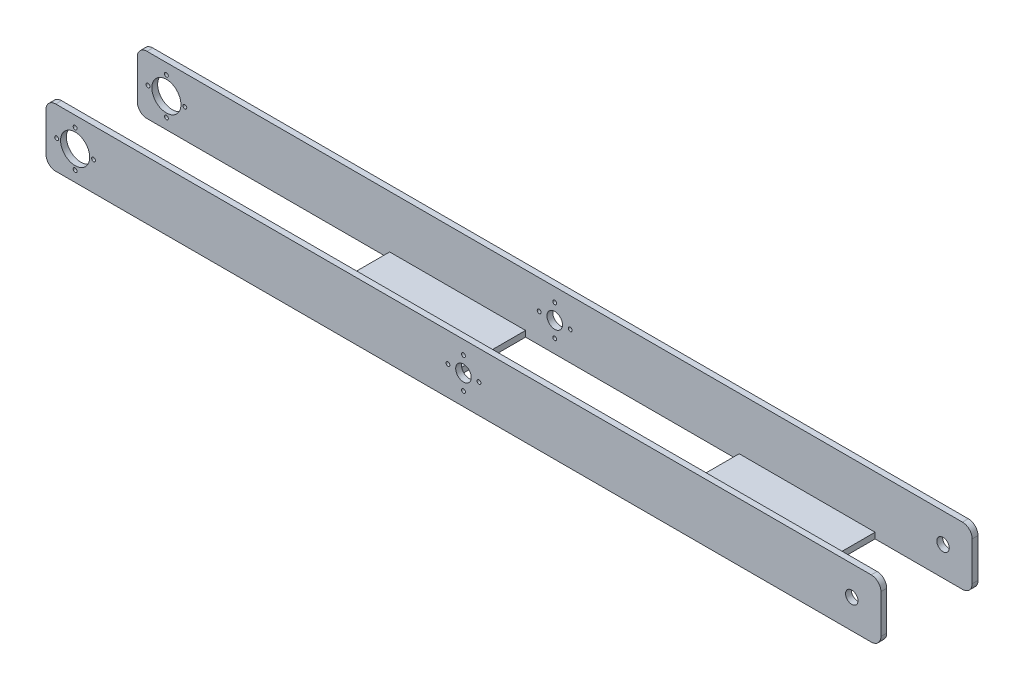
ISO-10303-21;
HEADER;
FILE_DESCRIPTION(('STEP AP214'),'2;1');
FILE_NAME('part.step','',(''),(''),'','','');
FILE_SCHEMA(('AUTOMOTIVE_DESIGN { 1 0 10303 214 1 1 1 1 }'));
ENDSEC;
DATA;
#1=APPLICATION_CONTEXT('core data for automotive mechanical design processes');
#2=APPLICATION_PROTOCOL_DEFINITION('international standard','automotive_design',2000,#1);
#3=PRODUCT_CONTEXT('',#1,'mechanical');
#4=PRODUCT('Part','Part','',(#3));
#5=PRODUCT_RELATED_PRODUCT_CATEGORY('part','',(#4));
#6=PRODUCT_DEFINITION_FORMATION('','',#4);
#7=PRODUCT_DEFINITION_CONTEXT('part definition',#1,'design');
#8=PRODUCT_DEFINITION('design','',#6,#7);
#9=PRODUCT_DEFINITION_SHAPE('','',#8);
#10=(LENGTH_UNIT() NAMED_UNIT(*) SI_UNIT(.MILLI.,.METRE.));
#11=(NAMED_UNIT(*) PLANE_ANGLE_UNIT() SI_UNIT($,.RADIAN.));
#12=(NAMED_UNIT(*) SI_UNIT($,.STERADIAN.) SOLID_ANGLE_UNIT());
#13=UNCERTAINTY_MEASURE_WITH_UNIT(LENGTH_MEASURE(1.E-05),#10,'distance_accuracy_value','');
#14=(GEOMETRIC_REPRESENTATION_CONTEXT(3) GLOBAL_UNCERTAINTY_ASSIGNED_CONTEXT((#13)) GLOBAL_UNIT_ASSIGNED_CONTEXT((#10,
#11,#12)) REPRESENTATION_CONTEXT('',''));
#15=CARTESIAN_POINT('',(0.,0.,0.));
#16=DIRECTION('',(0.,0.,1.));
#17=DIRECTION('',(1.,0.,0.));
#18=AXIS2_PLACEMENT_3D('',#15,#16,#17);
#19=CARTESIAN_POINT('',(215.,-15.,50.));
#20=DIRECTION('',(-1.,0.,0.));
#21=DIRECTION('',(0.,0.,1.));
#22=AXIS2_PLACEMENT_3D('',#19,#20,#21);
#23=PLANE('',#22);
#24=DIRECTION('',(0.,1.,0.));
#25=VECTOR('',#24,1.);
#26=CARTESIAN_POINT('',(215.,-15.,50.));
#27=LINE('',#26,#25);
#28=CARTESIAN_POINT('',(215.,-10.,50.));
#29=VERTEX_POINT('',#28);
#30=CARTESIAN_POINT('',(215.,10.,50.));
#31=VERTEX_POINT('',#30);
#32=EDGE_CURVE('E262',#29,#31,#27,.T.);
#33=ORIENTED_EDGE('',*,*,#32,.F.);
#34=DIRECTION('',(0.,0.,-1.));
#35=VECTOR('',#34,1.);
#36=CARTESIAN_POINT('',(215.,-10.,50.));
#37=LINE('',#36,#35);
#38=CARTESIAN_POINT('',(215.,-10.,47.));
#39=VERTEX_POINT('',#38);
#40=EDGE_CURVE('E387',#29,#39,#37,.T.);
#41=ORIENTED_EDGE('',*,*,#40,.T.);
#42=DIRECTION('',(0.,1.,0.));
#43=VECTOR('',#42,1.);
#44=CARTESIAN_POINT('',(215.,0.,47.));
#45=LINE('',#44,#43);
#46=CARTESIAN_POINT('',(215.,10.,47.));
#47=VERTEX_POINT('',#46);
#48=EDGE_CURVE('E259',#39,#47,#45,.T.);
#49=ORIENTED_EDGE('',*,*,#48,.T.);
#50=DIRECTION('',(0.,0.,-1.));
#51=VECTOR('',#50,1.);
#52=CARTESIAN_POINT('',(215.,10.,50.));
#53=LINE('',#52,#51);
#54=EDGE_CURVE('E385',#47,#31,#53,.F.);
#55=ORIENTED_EDGE('',*,*,#54,.T.);
#56=EDGE_LOOP('',(#33,#41,#49,#55));
#57=FACE_BOUND('',#56,.T.);
#58=ADVANCED_FACE('F43',(#57),#23,.F.);
#59=CARTESIAN_POINT('',(-215.,-15.,50.));
#60=DIRECTION('',(1.,0.,0.));
#61=DIRECTION('',(0.,0.,-1.));
#62=AXIS2_PLACEMENT_3D('',#59,#60,#61);
#63=PLANE('',#62);
#64=DIRECTION('',(0.,-1.,0.));
#65=VECTOR('',#64,1.);
#66=CARTESIAN_POINT('',(-215.,-15.,0.));
#67=LINE('',#66,#65);
#68=CARTESIAN_POINT('',(-215.,10.,0.));
#69=VERTEX_POINT('',#68);
#70=CARTESIAN_POINT('',(-215.,-10.,0.));
#71=VERTEX_POINT('',#70);
#72=EDGE_CURVE('E276',#69,#71,#67,.T.);
#73=ORIENTED_EDGE('',*,*,#72,.T.);
#74=DIRECTION('',(0.,0.,-1.));
#75=VECTOR('',#74,1.);
#76=CARTESIAN_POINT('',(-215.,-10.,50.));
#77=LINE('',#76,#75);
#78=CARTESIAN_POINT('',(-215.,-10.,3.));
#79=VERTEX_POINT('',#78);
#80=EDGE_CURVE('E346',#71,#79,#77,.F.);
#81=ORIENTED_EDGE('',*,*,#80,.T.);
#82=DIRECTION('',(0.,-1.,0.));
#83=VECTOR('',#82,1.);
#84=CARTESIAN_POINT('',(-215.,0.,3.));
#85=LINE('',#84,#83);
#86=CARTESIAN_POINT('',(-215.,10.,3.));
#87=VERTEX_POINT('',#86);
#88=EDGE_CURVE('E252',#87,#79,#85,.T.);
#89=ORIENTED_EDGE('',*,*,#88,.F.);
#90=DIRECTION('',(0.,0.,-1.));
#91=VECTOR('',#90,1.);
#92=CARTESIAN_POINT('',(-215.,10.,50.));
#93=LINE('',#92,#91);
#94=EDGE_CURVE('E343',#87,#69,#93,.T.);
#95=ORIENTED_EDGE('',*,*,#94,.T.);
#96=EDGE_LOOP('',(#73,#81,#89,#95));
#97=FACE_BOUND('',#96,.T.);
#98=ADVANCED_FACE('F418',(#97),#63,.F.);
#99=CARTESIAN_POINT('',(-215.,-12.,50.));
#100=DIRECTION('',(0.,1.,0.));
#101=DIRECTION('',(0.,0.,1.));
#102=AXIS2_PLACEMENT_3D('',#99,#100,#101);
#103=PLANE('',#102);
#104=DIRECTION('',(0.,0.,-1.));
#105=VECTOR('',#104,1.);
#106=CARTESIAN_POINT('',(-84.9999999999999,-12.,3.));
#107=LINE('',#106,#105);
#108=CARTESIAN_POINT('',(-84.9999999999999,-12.,47.));
#109=VERTEX_POINT('',#108);
#110=CARTESIAN_POINT('',(-84.9999999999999,-12.,3.));
#111=VERTEX_POINT('',#110);
#112=EDGE_CURVE('E209',#109,#111,#107,.T.);
#113=ORIENTED_EDGE('',*,*,#112,.F.);
#114=DIRECTION('',(1.,0.,0.));
#115=VECTOR('',#114,1.);
#116=CARTESIAN_POINT('',(0.,-12.,47.));
#117=LINE('',#116,#115);
#118=CARTESIAN_POINT('',(-14.9999999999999,-12.,47.));
#119=VERTEX_POINT('',#118);
#120=EDGE_CURVE('E224',#109,#119,#117,.T.);
#121=ORIENTED_EDGE('',*,*,#120,.T.);
#122=DIRECTION('',(0.,0.,1.));
#123=VECTOR('',#122,1.);
#124=CARTESIAN_POINT('',(-14.9999999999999,-12.,3.00000000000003));
#125=LINE('',#124,#123);
#126=CARTESIAN_POINT('',(-14.9999999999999,-12.,3.00000000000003));
#127=VERTEX_POINT('',#126);
#128=EDGE_CURVE('E462',#127,#119,#125,.T.);
#129=ORIENTED_EDGE('',*,*,#128,.F.);
#130=DIRECTION('',(1.,0.,0.));
#131=VECTOR('',#130,1.);
#132=CARTESIAN_POINT('',(0.,-12.,3.));
#133=LINE('',#132,#131);
#134=EDGE_CURVE('E226',#111,#127,#133,.T.);
#135=ORIENTED_EDGE('',*,*,#134,.F.);
#136=EDGE_LOOP('',(#113,#121,#129,#135));
#137=FACE_BOUND('',#136,.T.);
#138=ADVANCED_FACE('F222',(#137),#103,.T.);
#139=DIRECTION('',(0.,1.,0.));
#140=VECTOR('',#139,1.);
#141=CARTESIAN_POINT('',(215.,0.,3.));
#142=LINE('',#141,#140);
#143=CARTESIAN_POINT('',(215.,-10.,3.));
#144=VERTEX_POINT('',#143);
#145=CARTESIAN_POINT('',(215.,10.,3.));
#146=VERTEX_POINT('',#145);
#147=EDGE_CURVE('E245',#144,#146,#142,.T.);
#148=ORIENTED_EDGE('',*,*,#147,.F.);
#149=DIRECTION('',(0.,0.,-1.));
#150=VECTOR('',#149,1.);
#151=CARTESIAN_POINT('',(215.,-10.,50.));
#152=LINE('',#151,#150);
#153=CARTESIAN_POINT('',(215.,-10.,0.));
#154=VERTEX_POINT('',#153);
#155=EDGE_CURVE('E11',#144,#154,#152,.T.);
#156=ORIENTED_EDGE('',*,*,#155,.T.);
#157=DIRECTION('',(0.,1.,0.));
#158=VECTOR('',#157,1.);
#159=CARTESIAN_POINT('',(215.,-15.,0.));
#160=LINE('',#159,#158);
#161=CARTESIAN_POINT('',(215.,10.,0.));
#162=VERTEX_POINT('',#161);
#163=EDGE_CURVE('E233',#154,#162,#160,.T.);
#164=ORIENTED_EDGE('',*,*,#163,.T.);
#165=DIRECTION('',(0.,0.,-1.));
#166=VECTOR('',#165,1.);
#167=CARTESIAN_POINT('',(215.,10.,50.));
#168=LINE('',#167,#166);
#169=EDGE_CURVE('E51',#162,#146,#168,.F.);
#170=ORIENTED_EDGE('',*,*,#169,.T.);
#171=EDGE_LOOP('',(#148,#156,#164,#170));
#172=FACE_BOUND('',#171,.T.);
#173=ADVANCED_FACE('F392',(#172),#23,.F.);
#174=CARTESIAN_POINT('',(-215.,15.,50.));
#175=DIRECTION('',(0.,-1.,0.));
#176=DIRECTION('',(0.,0.,-1.));
#177=AXIS2_PLACEMENT_3D('',#174,#175,#176);
#178=PLANE('',#177);
#179=DIRECTION('',(-1.,0.,0.));
#180=VECTOR('',#179,1.);
#181=CARTESIAN_POINT('',(-215.,15.,0.));
#182=LINE('',#181,#180);
#183=CARTESIAN_POINT('',(210.,15.,0.));
#184=VERTEX_POINT('',#183);
#185=CARTESIAN_POINT('',(-210.,15.,0.));
#186=VERTEX_POINT('',#185);
#187=EDGE_CURVE('E237',#184,#186,#182,.T.);
#188=ORIENTED_EDGE('',*,*,#187,.T.);
#189=DIRECTION('',(0.,0.,-1.));
#190=VECTOR('',#189,1.);
#191=CARTESIAN_POINT('',(-210.,15.,50.));
#192=LINE('',#191,#190);
#193=CARTESIAN_POINT('',(-210.,15.,3.));
#194=VERTEX_POINT('',#193);
#195=EDGE_CURVE('E359',#186,#194,#192,.F.);
#196=ORIENTED_EDGE('',*,*,#195,.T.);
#197=DIRECTION('',(-1.,0.,0.));
#198=VECTOR('',#197,1.);
#199=CARTESIAN_POINT('',(0.,15.,3.));
#200=LINE('',#199,#198);
#201=CARTESIAN_POINT('',(210.,15.,3.));
#202=VERTEX_POINT('',#201);
#203=EDGE_CURVE('E248',#202,#194,#200,.T.);
#204=ORIENTED_EDGE('',*,*,#203,.F.);
#205=DIRECTION('',(0.,0.,-1.));
#206=VECTOR('',#205,1.);
#207=CARTESIAN_POINT('',(210.,15.,50.));
#208=LINE('',#207,#206);
#209=EDGE_CURVE('E356',#202,#184,#208,.T.);
#210=ORIENTED_EDGE('',*,*,#209,.T.);
#211=EDGE_LOOP('',(#188,#196,#204,#210));
#212=FACE_BOUND('',#211,.T.);
#213=ADVANCED_FACE('F406',(#212),#178,.F.);
#214=DIRECTION('',(0.,-1.,0.));
#215=VECTOR('',#214,1.);
#216=CARTESIAN_POINT('',(-215.,0.,47.));
#217=LINE('',#216,#215);
#218=CARTESIAN_POINT('',(-215.,10.,47.));
#219=VERTEX_POINT('',#218);
#220=CARTESIAN_POINT('',(-215.,-10.,47.));
#221=VERTEX_POINT('',#220);
#222=EDGE_CURVE('E240',#219,#221,#217,.T.);
#223=ORIENTED_EDGE('',*,*,#222,.T.);
#224=DIRECTION('',(0.,0.,-1.));
#225=VECTOR('',#224,1.);
#226=CARTESIAN_POINT('',(-215.,-10.,50.));
#227=LINE('',#226,#225);
#228=CARTESIAN_POINT('',(-215.,-10.,50.));
#229=VERTEX_POINT('',#228);
#230=EDGE_CURVE('E372',#221,#229,#227,.F.);
#231=ORIENTED_EDGE('',*,*,#230,.T.);
#232=DIRECTION('',(0.,-1.,0.));
#233=VECTOR('',#232,1.);
#234=CARTESIAN_POINT('',(-215.,-15.,50.));
#235=LINE('',#234,#233);
#236=CARTESIAN_POINT('',(-215.,10.,50.));
#237=VERTEX_POINT('',#236);
#238=EDGE_CURVE('E267',#237,#229,#235,.T.);
#239=ORIENTED_EDGE('',*,*,#238,.F.);
#240=DIRECTION('',(0.,0.,-1.));
#241=VECTOR('',#240,1.);
#242=CARTESIAN_POINT('',(-215.,10.,50.));
#243=LINE('',#242,#241);
#244=EDGE_CURVE('E369',#237,#219,#243,.T.);
#245=ORIENTED_EDGE('',*,*,#244,.T.);
#246=EDGE_LOOP('',(#223,#231,#239,#245));
#247=FACE_BOUND('',#246,.T.);
#248=ADVANCED_FACE('F592',(#247),#63,.F.);
#249=DIRECTION('',(-1.,0.,0.));
#250=VECTOR('',#249,1.);
#251=CARTESIAN_POINT('',(0.,15.,47.));
#252=LINE('',#251,#250);
#253=CARTESIAN_POINT('',(210.,15.,47.));
#254=VERTEX_POINT('',#253);
#255=CARTESIAN_POINT('',(-210.,15.,47.));
#256=VERTEX_POINT('',#255);
#257=EDGE_CURVE('E257',#254,#256,#252,.T.);
#258=ORIENTED_EDGE('',*,*,#257,.T.);
#259=DIRECTION('',(0.,0.,-1.));
#260=VECTOR('',#259,1.);
#261=CARTESIAN_POINT('',(-210.,15.,50.));
#262=LINE('',#261,#260);
#263=CARTESIAN_POINT('',(-210.,15.,50.));
#264=VERTEX_POINT('',#263);
#265=EDGE_CURVE('E58',#256,#264,#262,.F.);
#266=ORIENTED_EDGE('',*,*,#265,.T.);
#267=DIRECTION('',(-1.,0.,0.));
#268=VECTOR('',#267,1.);
#269=CARTESIAN_POINT('',(-215.,15.,50.));
#270=LINE('',#269,#268);
#271=CARTESIAN_POINT('',(210.,15.,50.));
#272=VERTEX_POINT('',#271);
#273=EDGE_CURVE('E264',#272,#264,#270,.T.);
#274=ORIENTED_EDGE('',*,*,#273,.F.);
#275=DIRECTION('',(0.,0.,-1.));
#276=VECTOR('',#275,1.);
#277=CARTESIAN_POINT('',(210.,15.,50.));
#278=LINE('',#277,#276);
#279=EDGE_CURVE('E381',#272,#254,#278,.T.);
#280=ORIENTED_EDGE('',*,*,#279,.T.);
#281=EDGE_LOOP('',(#258,#266,#274,#280));
#282=FACE_BOUND('',#281,.T.);
#283=ADVANCED_FACE('F601',(#282),#178,.F.);
#284=CARTESIAN_POINT('',(-215.,-15.,50.));
#285=DIRECTION('',(0.,1.,0.));
#286=DIRECTION('',(0.,0.,1.));
#287=AXIS2_PLACEMENT_3D('',#284,#285,#286);
#288=PLANE('',#287);
#289=DIRECTION('',(1.,0.,0.));
#290=VECTOR('',#289,1.);
#291=CARTESIAN_POINT('',(-14.9999999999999,-15.,3.00000000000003));
#292=LINE('',#291,#290);
#293=CARTESIAN_POINT('',(-14.9999999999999,-15.,3.00000000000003));
#294=VERTEX_POINT('',#293);
#295=CARTESIAN_POINT('',(95.0000000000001,-15.,3.00000000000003));
#296=VERTEX_POINT('',#295);
#297=EDGE_CURVE('E438',#294,#296,#292,.T.);
#298=ORIENTED_EDGE('',*,*,#297,.F.);
#299=DIRECTION('',(0.,0.,-1.));
#300=VECTOR('',#299,1.);
#301=CARTESIAN_POINT('',(-14.9999999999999,-15.,3.00000000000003));
#302=LINE('',#301,#300);
#303=CARTESIAN_POINT('',(-14.9999999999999,-15.,47.));
#304=VERTEX_POINT('',#303);
#305=EDGE_CURVE('E464',#304,#294,#302,.T.);
#306=ORIENTED_EDGE('',*,*,#305,.F.);
#307=DIRECTION('',(-1.,0.,0.));
#308=VECTOR('',#307,1.);
#309=CARTESIAN_POINT('',(-14.9999999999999,-15.,47.));
#310=LINE('',#309,#308);
#311=CARTESIAN_POINT('',(95.0000000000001,-15.,47.));
#312=VERTEX_POINT('',#311);
#313=EDGE_CURVE('E450',#312,#304,#310,.T.);
#314=ORIENTED_EDGE('',*,*,#313,.F.);
#315=DIRECTION('',(0.,0.,1.));
#316=VECTOR('',#315,1.);
#317=CARTESIAN_POINT('',(95.0000000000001,-15.,3.00000000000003));
#318=LINE('',#317,#316);
#319=EDGE_CURVE('E436',#296,#312,#318,.T.);
#320=ORIENTED_EDGE('',*,*,#319,.F.);
#321=EDGE_LOOP('',(#298,#306,#314,#320));
#322=FACE_BOUND('',#321,.T.);
#323=DIRECTION('',(1.,0.,0.));
#324=VECTOR('',#323,1.);
#325=CARTESIAN_POINT('',(-215.,-15.,3.));
#326=LINE('',#325,#324);
#327=CARTESIAN_POINT('',(-210.,-15.,3.));
#328=VERTEX_POINT('',#327);
#329=CARTESIAN_POINT('',(-84.9999999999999,-15.,3.));
#330=VERTEX_POINT('',#329);
#331=EDGE_CURVE('E227',#328,#330,#326,.T.);
#332=ORIENTED_EDGE('',*,*,#331,.F.);
#333=DIRECTION('',(0.,0.,-1.));
#334=VECTOR('',#333,1.);
#335=CARTESIAN_POINT('',(-210.,-15.,50.));
#336=LINE('',#335,#334);
#337=CARTESIAN_POINT('',(-210.,-15.,0.));
#338=VERTEX_POINT('',#337);
#339=EDGE_CURVE('E332',#328,#338,#336,.T.);
#340=ORIENTED_EDGE('',*,*,#339,.T.);
#341=DIRECTION('',(1.,0.,0.));
#342=VECTOR('',#341,1.);
#343=CARTESIAN_POINT('',(-215.,-15.,0.));
#344=LINE('',#343,#342);
#345=CARTESIAN_POINT('',(210.,-15.,0.));
#346=VERTEX_POINT('',#345);
#347=EDGE_CURVE('E265',#338,#346,#344,.T.);
#348=ORIENTED_EDGE('',*,*,#347,.T.);
#349=DIRECTION('',(0.,0.,-1.));
#350=VECTOR('',#349,1.);
#351=CARTESIAN_POINT('',(210.,-15.,50.));
#352=LINE('',#351,#350);
#353=CARTESIAN_POINT('',(210.,-15.,3.));
#354=VERTEX_POINT('',#353);
#355=EDGE_CURVE('E272',#346,#354,#352,.F.);
#356=ORIENTED_EDGE('',*,*,#355,.T.);
#357=DIRECTION('',(1.,0.,0.));
#358=VECTOR('',#357,1.);
#359=CARTESIAN_POINT('',(215.,-15.,3.));
#360=LINE('',#359,#358);
#361=CARTESIAN_POINT('',(165.,-15.,3.00000000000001));
#362=VERTEX_POINT('',#361);
#363=EDGE_CURVE('E432',#362,#354,#360,.T.);
#364=ORIENTED_EDGE('',*,*,#363,.F.);
#365=DIRECTION('',(0.,0.,-1.));
#366=VECTOR('',#365,1.);
#367=CARTESIAN_POINT('',(165.,-15.,3.00000000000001));
#368=LINE('',#367,#366);
#369=CARTESIAN_POINT('',(165.,-15.,47.));
#370=VERTEX_POINT('',#369);
#371=EDGE_CURVE('E448',#370,#362,#368,.T.);
#372=ORIENTED_EDGE('',*,*,#371,.F.);
#373=DIRECTION('',(-1.,0.,0.));
#374=VECTOR('',#373,1.);
#375=CARTESIAN_POINT('',(215.,-15.,47.));
#376=LINE('',#375,#374);
#377=CARTESIAN_POINT('',(210.,-15.,47.));
#378=VERTEX_POINT('',#377);
#379=EDGE_CURVE('E446',#378,#370,#376,.T.);
#380=ORIENTED_EDGE('',*,*,#379,.F.);
#381=DIRECTION('',(0.,0.,-1.));
#382=VECTOR('',#381,1.);
#383=CARTESIAN_POINT('',(210.,-15.,50.));
#384=LINE('',#383,#382);
#385=CARTESIAN_POINT('',(210.,-15.,50.));
#386=VERTEX_POINT('',#385);
#387=EDGE_CURVE('E327',#378,#386,#384,.F.);
#388=ORIENTED_EDGE('',*,*,#387,.T.);
#389=DIRECTION('',(1.,0.,0.));
#390=VECTOR('',#389,1.);
#391=CARTESIAN_POINT('',(-215.,-15.,50.));
#392=LINE('',#391,#390);
#393=CARTESIAN_POINT('',(-210.,-15.,50.));
#394=VERTEX_POINT('',#393);
#395=EDGE_CURVE('E270',#394,#386,#392,.T.);
#396=ORIENTED_EDGE('',*,*,#395,.F.);
#397=DIRECTION('',(0.,0.,-1.));
#398=VECTOR('',#397,1.);
#399=CARTESIAN_POINT('',(-210.,-15.,50.));
#400=LINE('',#399,#398);
#401=CARTESIAN_POINT('',(-210.,-15.,47.));
#402=VERTEX_POINT('',#401);
#403=EDGE_CURVE('E329',#394,#402,#400,.T.);
#404=ORIENTED_EDGE('',*,*,#403,.T.);
#405=DIRECTION('',(-1.,0.,0.));
#406=VECTOR('',#405,1.);
#407=CARTESIAN_POINT('',(-215.,-15.,47.));
#408=LINE('',#407,#406);
#409=CARTESIAN_POINT('',(-84.9999999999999,-15.,47.));
#410=VERTEX_POINT('',#409);
#411=EDGE_CURVE('E249',#410,#402,#408,.T.);
#412=ORIENTED_EDGE('',*,*,#411,.F.);
#413=DIRECTION('',(0.,0.,1.));
#414=VECTOR('',#413,1.);
#415=CARTESIAN_POINT('',(-84.9999999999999,-15.,3.));
#416=LINE('',#415,#414);
#417=EDGE_CURVE('E212',#330,#410,#416,.T.);
#418=ORIENTED_EDGE('',*,*,#417,.F.);
#419=EDGE_LOOP('',(#332,#340,#348,#356,#364,#372,#380,#388,#396,#404,#412,#418));
#420=FACE_BOUND('',#419,.T.);
#421=ADVANCED_FACE('F426',(#322,#420),#288,.F.);
#422=CARTESIAN_POINT('',(0.,0.,50.));
#423=DIRECTION('',(0.,0.,-1.));
#424=DIRECTION('',(-1.,0.,0.));
#425=AXIS2_PLACEMENT_3D('',#422,#423,#424);
#426=PLANE('',#425);
#427=CARTESIAN_POINT('',(8.,0.,50.));
#428=DIRECTION('',(0.,0.,-1.));
#429=DIRECTION('',(-1.,0.,0.));
#430=AXIS2_PLACEMENT_3D('',#427,#428,#429);
#431=CIRCLE('',#430,1.);
#432=CARTESIAN_POINT('',(7.,0.,50.));
#433=VERTEX_POINT('',#432);
#434=EDGE_CURVE('E541',#433,#433,#431,.T.);
#435=ORIENTED_EDGE('',*,*,#434,.T.);
#436=EDGE_LOOP('',(#435));
#437=FACE_BOUND('',#436,.T.);
#438=CARTESIAN_POINT('',(-8.,0.,50.));
#439=DIRECTION('',(0.,0.,-1.));
#440=DIRECTION('',(-1.,0.,0.));
#441=AXIS2_PLACEMENT_3D('',#438,#439,#440);
#442=CIRCLE('',#441,1.);
#443=CARTESIAN_POINT('',(-9.,0.,50.));
#444=VERTEX_POINT('',#443);
#445=EDGE_CURVE('E531',#444,#444,#442,.T.);
#446=ORIENTED_EDGE('',*,*,#445,.T.);
#447=EDGE_LOOP('',(#446));
#448=FACE_BOUND('',#447,.T.);
#449=CARTESIAN_POINT('',(0.,-8.,50.));
#450=DIRECTION('',(0.,0.,-1.));
#451=DIRECTION('',(-1.,0.,0.));
#452=AXIS2_PLACEMENT_3D('',#449,#450,#451);
#453=CIRCLE('',#452,1.);
#454=CARTESIAN_POINT('',(-1.,-8.,50.));
#455=VERTEX_POINT('',#454);
#456=EDGE_CURVE('E530',#455,#455,#453,.T.);
#457=ORIENTED_EDGE('',*,*,#456,.T.);
#458=EDGE_LOOP('',(#457));
#459=FACE_BOUND('',#458,.T.);
#460=CARTESIAN_POINT('',(0.,8.,50.));
#461=DIRECTION('',(0.,0.,-1.));
#462=DIRECTION('',(-1.,0.,0.));
#463=AXIS2_PLACEMENT_3D('',#460,#461,#462);
#464=CIRCLE('',#463,1.);
#465=CARTESIAN_POINT('',(-1.,8.,50.));
#466=VERTEX_POINT('',#465);
#467=EDGE_CURVE('E498',#466,#466,#464,.T.);
#468=ORIENTED_EDGE('',*,*,#467,.T.);
#469=EDGE_LOOP('',(#468));
#470=FACE_BOUND('',#469,.T.);
#471=CARTESIAN_POINT('',(-200.,-9.5,50.));
#472=DIRECTION('',(0.,0.,-1.));
#473=DIRECTION('',(-1.,0.,0.));
#474=AXIS2_PLACEMENT_3D('',#471,#472,#473);
#475=CIRCLE('',#474,0.999999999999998);
#476=CARTESIAN_POINT('',(-201.,-9.5,50.));
#477=VERTEX_POINT('',#476);
#478=EDGE_CURVE('E518',#477,#477,#475,.T.);
#479=ORIENTED_EDGE('',*,*,#478,.T.);
#480=EDGE_LOOP('',(#479));
#481=FACE_BOUND('',#480,.T.);
#482=CARTESIAN_POINT('',(-190.5,0.,50.));
#483=DIRECTION('',(0.,0.,-1.));
#484=DIRECTION('',(-1.,0.,0.));
#485=AXIS2_PLACEMENT_3D('',#482,#483,#484);
#486=CIRCLE('',#485,0.999999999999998);
#487=CARTESIAN_POINT('',(-191.5,0.,50.));
#488=VERTEX_POINT('',#487);
#489=EDGE_CURVE('E505',#488,#488,#486,.T.);
#490=ORIENTED_EDGE('',*,*,#489,.T.);
#491=EDGE_LOOP('',(#490));
#492=FACE_BOUND('',#491,.T.);
#493=CARTESIAN_POINT('',(-209.5,0.,50.));
#494=DIRECTION('',(0.,0.,-1.));
#495=DIRECTION('',(-1.,0.,0.));
#496=AXIS2_PLACEMENT_3D('',#493,#494,#495);
#497=CIRCLE('',#496,0.999999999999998);
#498=CARTESIAN_POINT('',(-210.5,0.,50.));
#499=VERTEX_POINT('',#498);
#500=EDGE_CURVE('E504',#499,#499,#497,.T.);
#501=ORIENTED_EDGE('',*,*,#500,.T.);
#502=EDGE_LOOP('',(#501));
#503=FACE_BOUND('',#502,.T.);
#504=CARTESIAN_POINT('',(-200.,9.5,50.));
#505=DIRECTION('',(0.,0.,-1.));
#506=DIRECTION('',(-1.,0.,0.));
#507=AXIS2_PLACEMENT_3D('',#504,#505,#506);
#508=CIRCLE('',#507,0.999999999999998);
#509=CARTESIAN_POINT('',(-201.,9.5,50.));
#510=VERTEX_POINT('',#509);
#511=EDGE_CURVE('E511',#510,#510,#508,.T.);
#512=ORIENTED_EDGE('',*,*,#511,.T.);
#513=EDGE_LOOP('',(#512));
#514=FACE_BOUND('',#513,.T.);
#515=CARTESIAN_POINT('',(-200.,0.,50.));
#516=DIRECTION('',(0.,0.,-1.));
#517=DIRECTION('',(-1.,0.,0.));
#518=AXIS2_PLACEMENT_3D('',#515,#516,#517);
#519=CIRCLE('',#518,7.50000000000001);
#520=CARTESIAN_POINT('',(-207.5,0.,50.));
#521=VERTEX_POINT('',#520);
#522=EDGE_CURVE('E519',#521,#521,#519,.T.);
#523=ORIENTED_EDGE('',*,*,#522,.T.);
#524=EDGE_LOOP('',(#523));
#525=FACE_BOUND('',#524,.T.);
#526=CARTESIAN_POINT('',(200.,0.,50.));
#527=DIRECTION('',(0.,0.,-1.));
#528=DIRECTION('',(-1.,0.,0.));
#529=AXIS2_PLACEMENT_3D('',#526,#527,#528);
#530=CIRCLE('',#529,3.20000000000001);
#531=CARTESIAN_POINT('',(196.8,0.,50.));
#532=VERTEX_POINT('',#531);
#533=EDGE_CURVE('E552',#532,#532,#530,.T.);
#534=ORIENTED_EDGE('',*,*,#533,.T.);
#535=EDGE_LOOP('',(#534));
#536=FACE_BOUND('',#535,.T.);
#537=CARTESIAN_POINT('',(0.,0.,50.));
#538=DIRECTION('',(0.,0.,-1.));
#539=DIRECTION('',(-1.,0.,0.));
#540=AXIS2_PLACEMENT_3D('',#537,#538,#539);
#541=CIRCLE('',#540,4.);
#542=CARTESIAN_POINT('',(-4.,0.,50.));
#543=VERTEX_POINT('',#542);
#544=EDGE_CURVE('E285',#543,#543,#541,.T.);
#545=ORIENTED_EDGE('',*,*,#544,.T.);
#546=EDGE_LOOP('',(#545));
#547=FACE_BOUND('',#546,.T.);
#548=ORIENTED_EDGE('',*,*,#238,.T.);
#549=CARTESIAN_POINT('',(-210.,-10.,50.));
#550=DIRECTION('',(0.,0.,-1.));
#551=DIRECTION('',(-1.,0.,0.));
#552=AXIS2_PLACEMENT_3D('',#549,#550,#551);
#553=CIRCLE('',#552,5.);
#554=EDGE_CURVE('E379',#229,#394,#553,.F.);
#555=ORIENTED_EDGE('',*,*,#554,.T.);
#556=ORIENTED_EDGE('',*,*,#395,.T.);
#557=CARTESIAN_POINT('',(210.,-10.,50.));
#558=DIRECTION('',(0.,0.,-1.));
#559=DIRECTION('',(-1.,0.,0.));
#560=AXIS2_PLACEMENT_3D('',#557,#558,#559);
#561=CIRCLE('',#560,5.);
#562=EDGE_CURVE('E375',#386,#29,#561,.F.);
#563=ORIENTED_EDGE('',*,*,#562,.T.);
#564=ORIENTED_EDGE('',*,*,#32,.T.);
#565=CARTESIAN_POINT('',(210.,10.,50.));
#566=DIRECTION('',(0.,0.,-1.));
#567=DIRECTION('',(-1.,0.,0.));
#568=AXIS2_PLACEMENT_3D('',#565,#566,#567);
#569=CIRCLE('',#568,5.);
#570=EDGE_CURVE('E65',#31,#272,#569,.F.);
#571=ORIENTED_EDGE('',*,*,#570,.T.);
#572=ORIENTED_EDGE('',*,*,#273,.T.);
#573=CARTESIAN_POINT('',(-210.,10.,50.));
#574=DIRECTION('',(0.,0.,-1.));
#575=DIRECTION('',(-1.,0.,0.));
#576=AXIS2_PLACEMENT_3D('',#573,#574,#575);
#577=CIRCLE('',#576,5.);
#578=EDGE_CURVE('E377',#264,#237,#577,.F.);
#579=ORIENTED_EDGE('',*,*,#578,.T.);
#580=EDGE_LOOP('',(#548,#555,#556,#563,#564,#571,#572,#579));
#581=FACE_BOUND('',#580,.T.);
#582=ADVANCED_FACE('F561',(#437,#448,#459,#470,#481,#492,#503,#514,#525,#536,#547,#581),#426,.F.);
#583=CARTESIAN_POINT('',(0.,0.,0.));
#584=DIRECTION('',(0.,0.,-1.));
#585=DIRECTION('',(-1.,0.,0.));
#586=AXIS2_PLACEMENT_3D('',#583,#584,#585);
#587=PLANE('',#586);
#588=CARTESIAN_POINT('',(8.,0.,0.));
#589=DIRECTION('',(0.,0.,-1.));
#590=DIRECTION('',(-1.,0.,0.));
#591=AXIS2_PLACEMENT_3D('',#588,#589,#590);
#592=CIRCLE('',#591,1.);
#593=CARTESIAN_POINT('',(7.,0.,0.));
#594=VERTEX_POINT('',#593);
#595=EDGE_CURVE('E514',#594,#594,#592,.T.);
#596=ORIENTED_EDGE('',*,*,#595,.F.);
#597=EDGE_LOOP('',(#596));
#598=FACE_BOUND('',#597,.T.);
#599=CARTESIAN_POINT('',(-8.,0.,0.));
#600=DIRECTION('',(0.,0.,-1.));
#601=DIRECTION('',(-1.,0.,0.));
#602=AXIS2_PLACEMENT_3D('',#599,#600,#601);
#603=CIRCLE('',#602,1.);
#604=CARTESIAN_POINT('',(-9.,0.,0.));
#605=VERTEX_POINT('',#604);
#606=EDGE_CURVE('E544',#605,#605,#603,.T.);
#607=ORIENTED_EDGE('',*,*,#606,.F.);
#608=EDGE_LOOP('',(#607));
#609=FACE_BOUND('',#608,.T.);
#610=CARTESIAN_POINT('',(0.,-8.,0.));
#611=DIRECTION('',(0.,0.,-1.));
#612=DIRECTION('',(-1.,0.,0.));
#613=AXIS2_PLACEMENT_3D('',#610,#611,#612);
#614=CIRCLE('',#613,1.);
#615=CARTESIAN_POINT('',(-1.,-8.,0.));
#616=VERTEX_POINT('',#615);
#617=EDGE_CURVE('E527',#616,#616,#614,.T.);
#618=ORIENTED_EDGE('',*,*,#617,.F.);
#619=EDGE_LOOP('',(#618));
#620=FACE_BOUND('',#619,.T.);
#621=CARTESIAN_POINT('',(0.,8.,0.));
#622=DIRECTION('',(0.,0.,-1.));
#623=DIRECTION('',(-1.,0.,0.));
#624=AXIS2_PLACEMENT_3D('',#621,#622,#623);
#625=CIRCLE('',#624,1.);
#626=CARTESIAN_POINT('',(-1.,8.,0.));
#627=VERTEX_POINT('',#626);
#628=EDGE_CURVE('E534',#627,#627,#625,.T.);
#629=ORIENTED_EDGE('',*,*,#628,.F.);
#630=EDGE_LOOP('',(#629));
#631=FACE_BOUND('',#630,.T.);
#632=CARTESIAN_POINT('',(-200.,-9.5,0.));
#633=DIRECTION('',(0.,0.,-1.));
#634=DIRECTION('',(-1.,0.,0.));
#635=AXIS2_PLACEMENT_3D('',#632,#633,#634);
#636=CIRCLE('',#635,0.999999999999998);
#637=CARTESIAN_POINT('',(-201.,-9.5,0.));
#638=VERTEX_POINT('',#637);
#639=EDGE_CURVE('E515',#638,#638,#636,.T.);
#640=ORIENTED_EDGE('',*,*,#639,.F.);
#641=EDGE_LOOP('',(#640));
#642=FACE_BOUND('',#641,.T.);
#643=CARTESIAN_POINT('',(-190.5,0.,0.));
#644=DIRECTION('',(0.,0.,-1.));
#645=DIRECTION('',(-1.,0.,0.));
#646=AXIS2_PLACEMENT_3D('',#643,#644,#645);
#647=CIRCLE('',#646,0.999999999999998);
#648=CARTESIAN_POINT('',(-191.5,0.,0.));
#649=VERTEX_POINT('',#648);
#650=EDGE_CURVE('E522',#649,#649,#647,.T.);
#651=ORIENTED_EDGE('',*,*,#650,.F.);
#652=EDGE_LOOP('',(#651));
#653=FACE_BOUND('',#652,.T.);
#654=CARTESIAN_POINT('',(-209.5,0.,0.));
#655=DIRECTION('',(0.,0.,-1.));
#656=DIRECTION('',(-1.,0.,0.));
#657=AXIS2_PLACEMENT_3D('',#654,#655,#656);
#658=CIRCLE('',#657,0.999999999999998);
#659=CARTESIAN_POINT('',(-210.5,0.,0.));
#660=VERTEX_POINT('',#659);
#661=EDGE_CURVE('E501',#660,#660,#658,.T.);
#662=ORIENTED_EDGE('',*,*,#661,.F.);
#663=EDGE_LOOP('',(#662));
#664=FACE_BOUND('',#663,.T.);
#665=CARTESIAN_POINT('',(-200.,9.5,0.));
#666=DIRECTION('',(0.,0.,-1.));
#667=DIRECTION('',(-1.,0.,0.));
#668=AXIS2_PLACEMENT_3D('',#665,#666,#667);
#669=CIRCLE('',#668,0.999999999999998);
#670=CARTESIAN_POINT('',(-201.,9.5,0.));
#671=VERTEX_POINT('',#670);
#672=EDGE_CURVE('E508',#671,#671,#669,.T.);
#673=ORIENTED_EDGE('',*,*,#672,.F.);
#674=EDGE_LOOP('',(#673));
#675=FACE_BOUND('',#674,.T.);
#676=CARTESIAN_POINT('',(-200.,0.,0.));
#677=DIRECTION('',(0.,0.,-1.));
#678=DIRECTION('',(-1.,0.,0.));
#679=AXIS2_PLACEMENT_3D('',#676,#677,#678);
#680=CIRCLE('',#679,7.50000000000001);
#681=CARTESIAN_POINT('',(-207.5,0.,0.));
#682=VERTEX_POINT('',#681);
#683=EDGE_CURVE('E555',#682,#682,#680,.T.);
#684=ORIENTED_EDGE('',*,*,#683,.F.);
#685=EDGE_LOOP('',(#684));
#686=FACE_BOUND('',#685,.T.);
#687=CARTESIAN_POINT('',(200.,0.,0.));
#688=DIRECTION('',(0.,0.,-1.));
#689=DIRECTION('',(-1.,0.,0.));
#690=AXIS2_PLACEMENT_3D('',#687,#688,#689);
#691=CIRCLE('',#690,3.20000000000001);
#692=CARTESIAN_POINT('',(196.8,0.,0.));
#693=VERTEX_POINT('',#692);
#694=EDGE_CURVE('E549',#693,#693,#691,.T.);
#695=ORIENTED_EDGE('',*,*,#694,.F.);
#696=EDGE_LOOP('',(#695));
#697=FACE_BOUND('',#696,.T.);
#698=CARTESIAN_POINT('',(0.,0.,0.));
#699=DIRECTION('',(0.,0.,-1.));
#700=DIRECTION('',(-1.,0.,0.));
#701=AXIS2_PLACEMENT_3D('',#698,#699,#700);
#702=CIRCLE('',#701,4.);
#703=CARTESIAN_POINT('',(-4.,0.,0.));
#704=VERTEX_POINT('',#703);
#705=EDGE_CURVE('E495',#704,#704,#702,.T.);
#706=ORIENTED_EDGE('',*,*,#705,.F.);
#707=EDGE_LOOP('',(#706));
#708=FACE_BOUND('',#707,.T.);
#709=ORIENTED_EDGE('',*,*,#347,.F.);
#710=CARTESIAN_POINT('',(-210.,-10.,0.));
#711=DIRECTION('',(0.,0.,-1.));
#712=DIRECTION('',(-1.,0.,0.));
#713=AXIS2_PLACEMENT_3D('',#710,#711,#712);
#714=CIRCLE('',#713,5.);
#715=EDGE_CURVE('E341',#338,#71,#714,.T.);
#716=ORIENTED_EDGE('',*,*,#715,.T.);
#717=ORIENTED_EDGE('',*,*,#72,.F.);
#718=CARTESIAN_POINT('',(-210.,10.,0.));
#719=DIRECTION('',(0.,0.,-1.));
#720=DIRECTION('',(-1.,0.,0.));
#721=AXIS2_PLACEMENT_3D('',#718,#719,#720);
#722=CIRCLE('',#721,5.);
#723=EDGE_CURVE('E339',#69,#186,#722,.T.);
#724=ORIENTED_EDGE('',*,*,#723,.T.);
#725=ORIENTED_EDGE('',*,*,#187,.F.);
#726=CARTESIAN_POINT('',(210.,10.,0.));
#727=DIRECTION('',(0.,0.,-1.));
#728=DIRECTION('',(-1.,0.,0.));
#729=AXIS2_PLACEMENT_3D('',#726,#727,#728);
#730=CIRCLE('',#729,5.);
#731=EDGE_CURVE('E335',#184,#162,#730,.T.);
#732=ORIENTED_EDGE('',*,*,#731,.T.);
#733=ORIENTED_EDGE('',*,*,#163,.F.);
#734=CARTESIAN_POINT('',(210.,-10.,0.));
#735=DIRECTION('',(0.,0.,-1.));
#736=DIRECTION('',(-1.,0.,0.));
#737=AXIS2_PLACEMENT_3D('',#734,#735,#736);
#738=CIRCLE('',#737,5.);
#739=EDGE_CURVE('E337',#154,#346,#738,.T.);
#740=ORIENTED_EDGE('',*,*,#739,.T.);
#741=EDGE_LOOP('',(#709,#716,#717,#724,#725,#732,#733,#740));
#742=FACE_BOUND('',#741,.T.);
#743=ADVANCED_FACE('F410',(#598,#609,#620,#631,#642,#653,#664,#675,#686,#697,#708,#742),#587,.T.);
#744=DIRECTION('',(0.,0.,-1.));
#745=VECTOR('',#744,1.);
#746=CARTESIAN_POINT('',(95.0000000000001,-12.,3.00000000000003));
#747=LINE('',#746,#745);
#748=CARTESIAN_POINT('',(95.0000000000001,-12.,47.));
#749=VERTEX_POINT('',#748);
#750=CARTESIAN_POINT('',(95.0000000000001,-12.,3.));
#751=VERTEX_POINT('',#750);
#752=EDGE_CURVE('E455',#749,#751,#747,.T.);
#753=ORIENTED_EDGE('',*,*,#752,.F.);
#754=CARTESIAN_POINT('',(165.,-12.,47.));
#755=VERTEX_POINT('',#754);
#756=EDGE_CURVE('E234',#749,#755,#117,.T.);
#757=ORIENTED_EDGE('',*,*,#756,.T.);
#758=DIRECTION('',(0.,0.,1.));
#759=VECTOR('',#758,1.);
#760=CARTESIAN_POINT('',(165.,-12.,3.00000000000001));
#761=LINE('',#760,#759);
#762=CARTESIAN_POINT('',(165.,-12.,3.00000000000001));
#763=VERTEX_POINT('',#762);
#764=EDGE_CURVE('E442',#763,#755,#761,.T.);
#765=ORIENTED_EDGE('',*,*,#764,.F.);
#766=EDGE_CURVE('E243',#751,#763,#133,.T.);
#767=ORIENTED_EDGE('',*,*,#766,.F.);
#768=EDGE_LOOP('',(#753,#757,#765,#767));
#769=FACE_BOUND('',#768,.T.);
#770=ADVANCED_FACE('F603',(#769),#103,.T.);
#771=CARTESIAN_POINT('',(0.,0.,47.));
#772=DIRECTION('',(0.,0.,-1.));
#773=DIRECTION('',(-1.,0.,0.));
#774=AXIS2_PLACEMENT_3D('',#771,#772,#773);
#775=PLANE('',#774);
#776=CARTESIAN_POINT('',(8.,0.,47.));
#777=DIRECTION('',(0.,0.,-1.));
#778=DIRECTION('',(-1.,0.,0.));
#779=AXIS2_PLACEMENT_3D('',#776,#777,#778);
#780=CIRCLE('',#779,1.);
#781=CARTESIAN_POINT('',(7.,0.,47.));
#782=VERTEX_POINT('',#781);
#783=EDGE_CURVE('E325',#782,#782,#780,.T.);
#784=ORIENTED_EDGE('',*,*,#783,.F.);
#785=EDGE_LOOP('',(#784));
#786=FACE_BOUND('',#785,.T.);
#787=CARTESIAN_POINT('',(-8.,0.,47.));
#788=DIRECTION('',(0.,0.,-1.));
#789=DIRECTION('',(-1.,0.,0.));
#790=AXIS2_PLACEMENT_3D('',#787,#788,#789);
#791=CIRCLE('',#790,1.);
#792=CARTESIAN_POINT('',(-9.,0.,47.));
#793=VERTEX_POINT('',#792);
#794=EDGE_CURVE('E321',#793,#793,#791,.T.);
#795=ORIENTED_EDGE('',*,*,#794,.F.);
#796=EDGE_LOOP('',(#795));
#797=FACE_BOUND('',#796,.T.);
#798=CARTESIAN_POINT('',(0.,-8.,47.));
#799=DIRECTION('',(0.,0.,-1.));
#800=DIRECTION('',(-1.,0.,0.));
#801=AXIS2_PLACEMENT_3D('',#798,#799,#800);
#802=CIRCLE('',#801,1.);
#803=CARTESIAN_POINT('',(-1.,-8.,47.));
#804=VERTEX_POINT('',#803);
#805=EDGE_CURVE('E317',#804,#804,#802,.T.);
#806=ORIENTED_EDGE('',*,*,#805,.F.);
#807=EDGE_LOOP('',(#806));
#808=FACE_BOUND('',#807,.T.);
#809=CARTESIAN_POINT('',(0.,8.,47.));
#810=DIRECTION('',(0.,0.,-1.));
#811=DIRECTION('',(-1.,0.,0.));
#812=AXIS2_PLACEMENT_3D('',#809,#810,#811);
#813=CIRCLE('',#812,1.);
#814=CARTESIAN_POINT('',(-1.,8.,47.));
#815=VERTEX_POINT('',#814);
#816=EDGE_CURVE('E313',#815,#815,#813,.T.);
#817=ORIENTED_EDGE('',*,*,#816,.F.);
#818=EDGE_LOOP('',(#817));
#819=FACE_BOUND('',#818,.T.);
#820=CARTESIAN_POINT('',(-200.,-9.5,47.));
#821=DIRECTION('',(0.,0.,-1.));
#822=DIRECTION('',(-1.,0.,0.));
#823=AXIS2_PLACEMENT_3D('',#820,#821,#822);
#824=CIRCLE('',#823,0.999999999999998);
#825=CARTESIAN_POINT('',(-201.,-9.5,47.));
#826=VERTEX_POINT('',#825);
#827=EDGE_CURVE('E309',#826,#826,#824,.T.);
#828=ORIENTED_EDGE('',*,*,#827,.F.);
#829=EDGE_LOOP('',(#828));
#830=FACE_BOUND('',#829,.T.);
#831=CARTESIAN_POINT('',(-190.5,0.,47.));
#832=DIRECTION('',(0.,0.,-1.));
#833=DIRECTION('',(-1.,0.,0.));
#834=AXIS2_PLACEMENT_3D('',#831,#832,#833);
#835=CIRCLE('',#834,0.999999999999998);
#836=CARTESIAN_POINT('',(-191.5,0.,47.));
#837=VERTEX_POINT('',#836);
#838=EDGE_CURVE('E305',#837,#837,#835,.T.);
#839=ORIENTED_EDGE('',*,*,#838,.F.);
#840=EDGE_LOOP('',(#839));
#841=FACE_BOUND('',#840,.T.);
#842=CARTESIAN_POINT('',(-209.5,0.,47.));
#843=DIRECTION('',(0.,0.,-1.));
#844=DIRECTION('',(-1.,0.,0.));
#845=AXIS2_PLACEMENT_3D('',#842,#843,#844);
#846=CIRCLE('',#845,0.999999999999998);
#847=CARTESIAN_POINT('',(-210.5,0.,47.));
#848=VERTEX_POINT('',#847);
#849=EDGE_CURVE('E301',#848,#848,#846,.T.);
#850=ORIENTED_EDGE('',*,*,#849,.F.);
#851=EDGE_LOOP('',(#850));
#852=FACE_BOUND('',#851,.T.);
#853=CARTESIAN_POINT('',(-200.,9.5,47.));
#854=DIRECTION('',(0.,0.,-1.));
#855=DIRECTION('',(-1.,0.,0.));
#856=AXIS2_PLACEMENT_3D('',#853,#854,#855);
#857=CIRCLE('',#856,0.999999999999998);
#858=CARTESIAN_POINT('',(-201.,9.5,47.));
#859=VERTEX_POINT('',#858);
#860=EDGE_CURVE('E297',#859,#859,#857,.T.);
#861=ORIENTED_EDGE('',*,*,#860,.F.);
#862=EDGE_LOOP('',(#861));
#863=FACE_BOUND('',#862,.T.);
#864=CARTESIAN_POINT('',(-200.,0.,47.));
#865=DIRECTION('',(0.,0.,-1.));
#866=DIRECTION('',(-1.,0.,0.));
#867=AXIS2_PLACEMENT_3D('',#864,#865,#866);
#868=CIRCLE('',#867,7.50000000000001);
#869=CARTESIAN_POINT('',(-207.5,0.,47.));
#870=VERTEX_POINT('',#869);
#871=EDGE_CURVE('E293',#870,#870,#868,.T.);
#872=ORIENTED_EDGE('',*,*,#871,.F.);
#873=EDGE_LOOP('',(#872));
#874=FACE_BOUND('',#873,.T.);
#875=CARTESIAN_POINT('',(200.,0.,47.));
#876=DIRECTION('',(0.,0.,-1.));
#877=DIRECTION('',(-1.,0.,0.));
#878=AXIS2_PLACEMENT_3D('',#875,#876,#877);
#879=CIRCLE('',#878,3.20000000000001);
#880=CARTESIAN_POINT('',(196.8,0.,47.));
#881=VERTEX_POINT('',#880);
#882=EDGE_CURVE('E289',#881,#881,#879,.T.);
#883=ORIENTED_EDGE('',*,*,#882,.F.);
#884=EDGE_LOOP('',(#883));
#885=FACE_BOUND('',#884,.T.);
#886=CARTESIAN_POINT('',(0.,0.,47.));
#887=DIRECTION('',(0.,0.,-1.));
#888=DIRECTION('',(-1.,0.,0.));
#889=AXIS2_PLACEMENT_3D('',#886,#887,#888);
#890=CIRCLE('',#889,4.);
#891=CARTESIAN_POINT('',(-4.,0.,47.));
#892=VERTEX_POINT('',#891);
#893=EDGE_CURVE('E284',#892,#892,#890,.T.);
#894=ORIENTED_EDGE('',*,*,#893,.F.);
#895=EDGE_LOOP('',(#894));
#896=FACE_BOUND('',#895,.T.);
#897=ORIENTED_EDGE('',*,*,#411,.T.);
#898=CARTESIAN_POINT('',(-210.,-10.,47.));
#899=DIRECTION('',(0.,0.,-1.));
#900=DIRECTION('',(-1.,0.,0.));
#901=AXIS2_PLACEMENT_3D('',#898,#899,#900);
#902=CIRCLE('',#901,5.);
#903=EDGE_CURVE('E367',#402,#221,#902,.T.);
#904=ORIENTED_EDGE('',*,*,#903,.T.);
#905=ORIENTED_EDGE('',*,*,#222,.F.);
#906=CARTESIAN_POINT('',(-210.,10.,47.));
#907=DIRECTION('',(0.,0.,-1.));
#908=DIRECTION('',(-1.,0.,0.));
#909=AXIS2_PLACEMENT_3D('',#906,#907,#908);
#910=CIRCLE('',#909,5.);
#911=EDGE_CURVE('E365',#219,#256,#910,.T.);
#912=ORIENTED_EDGE('',*,*,#911,.T.);
#913=ORIENTED_EDGE('',*,*,#257,.F.);
#914=CARTESIAN_POINT('',(210.,10.,47.));
#915=DIRECTION('',(0.,0.,-1.));
#916=DIRECTION('',(-1.,0.,0.));
#917=AXIS2_PLACEMENT_3D('',#914,#915,#916);
#918=CIRCLE('',#917,5.);
#919=EDGE_CURVE('E361',#254,#47,#918,.T.);
#920=ORIENTED_EDGE('',*,*,#919,.T.);
#921=ORIENTED_EDGE('',*,*,#48,.F.);
#922=CARTESIAN_POINT('',(210.,-10.,47.));
#923=DIRECTION('',(0.,0.,-1.));
#924=DIRECTION('',(-1.,0.,0.));
#925=AXIS2_PLACEMENT_3D('',#922,#923,#924);
#926=CIRCLE('',#925,5.);
#927=EDGE_CURVE('E363',#39,#378,#926,.T.);
#928=ORIENTED_EDGE('',*,*,#927,.T.);
#929=ORIENTED_EDGE('',*,*,#379,.T.);
#930=DIRECTION('',(0.,1.,0.));
#931=VECTOR('',#930,1.);
#932=CARTESIAN_POINT('',(165.,-15.001,47.));
#933=LINE('',#932,#931);
#934=EDGE_CURVE('E437',#370,#755,#933,.T.);
#935=ORIENTED_EDGE('',*,*,#934,.T.);
#936=ORIENTED_EDGE('',*,*,#756,.F.);
#937=DIRECTION('',(0.,1.,0.));
#938=VECTOR('',#937,1.);
#939=CARTESIAN_POINT('',(95.0000000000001,-15.001,47.));
#940=LINE('',#939,#938);
#941=EDGE_CURVE('E454',#312,#749,#940,.T.);
#942=ORIENTED_EDGE('',*,*,#941,.F.);
#943=ORIENTED_EDGE('',*,*,#313,.T.);
#944=DIRECTION('',(0.,1.,0.));
#945=VECTOR('',#944,1.);
#946=CARTESIAN_POINT('',(-14.9999999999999,-15.001,47.));
#947=LINE('',#946,#945);
#948=EDGE_CURVE('E231',#304,#119,#947,.T.);
#949=ORIENTED_EDGE('',*,*,#948,.T.);
#950=ORIENTED_EDGE('',*,*,#120,.F.);
#951=DIRECTION('',(0.,1.,0.));
#952=VECTOR('',#951,1.);
#953=CARTESIAN_POINT('',(-84.9999999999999,-15.001,47.));
#954=LINE('',#953,#952);
#955=EDGE_CURVE('E205',#410,#109,#954,.T.);
#956=ORIENTED_EDGE('',*,*,#955,.F.);
#957=EDGE_LOOP('',(#897,#904,#905,#912,#913,#920,#921,#928,#929,#935,#936,#942,#943,#949,#950,#956));
#958=FACE_BOUND('',#957,.T.);
#959=ADVANCED_FACE('F229',(#786,#797,#808,#819,#830,#841,#852,#863,#874,#885,#896,#958),#775,.T.);
#960=CARTESIAN_POINT('',(0.,0.,3.));
#961=DIRECTION('',(0.,0.,-1.));
#962=DIRECTION('',(-1.,0.,0.));
#963=AXIS2_PLACEMENT_3D('',#960,#961,#962);
#964=PLANE('',#963);
#965=CARTESIAN_POINT('',(8.,0.,3.));
#966=DIRECTION('',(0.,0.,-1.));
#967=DIRECTION('',(-1.,0.,0.));
#968=AXIS2_PLACEMENT_3D('',#965,#966,#967);
#969=CIRCLE('',#968,1.);
#970=CARTESIAN_POINT('',(7.,0.,3.));
#971=VERTEX_POINT('',#970);
#972=EDGE_CURVE('E322',#971,#971,#969,.T.);
#973=ORIENTED_EDGE('',*,*,#972,.T.);
#974=EDGE_LOOP('',(#973));
#975=FACE_BOUND('',#974,.T.);
#976=CARTESIAN_POINT('',(-8.,0.,3.));
#977=DIRECTION('',(0.,0.,-1.));
#978=DIRECTION('',(-1.,0.,0.));
#979=AXIS2_PLACEMENT_3D('',#976,#977,#978);
#980=CIRCLE('',#979,1.);
#981=CARTESIAN_POINT('',(-9.,0.,3.));
#982=VERTEX_POINT('',#981);
#983=EDGE_CURVE('E318',#982,#982,#980,.T.);
#984=ORIENTED_EDGE('',*,*,#983,.T.);
#985=EDGE_LOOP('',(#984));
#986=FACE_BOUND('',#985,.T.);
#987=CARTESIAN_POINT('',(0.,-8.,3.));
#988=DIRECTION('',(0.,0.,-1.));
#989=DIRECTION('',(-1.,0.,0.));
#990=AXIS2_PLACEMENT_3D('',#987,#988,#989);
#991=CIRCLE('',#990,1.);
#992=CARTESIAN_POINT('',(-1.,-8.,3.));
#993=VERTEX_POINT('',#992);
#994=EDGE_CURVE('E314',#993,#993,#991,.T.);
#995=ORIENTED_EDGE('',*,*,#994,.T.);
#996=EDGE_LOOP('',(#995));
#997=FACE_BOUND('',#996,.T.);
#998=CARTESIAN_POINT('',(0.,8.,3.));
#999=DIRECTION('',(0.,0.,-1.));
#1000=DIRECTION('',(-1.,0.,0.));
#1001=AXIS2_PLACEMENT_3D('',#998,#999,#1000);
#1002=CIRCLE('',#1001,1.);
#1003=CARTESIAN_POINT('',(-1.,8.,3.));
#1004=VERTEX_POINT('',#1003);
#1005=EDGE_CURVE('E310',#1004,#1004,#1002,.T.);
#1006=ORIENTED_EDGE('',*,*,#1005,.T.);
#1007=EDGE_LOOP('',(#1006));
#1008=FACE_BOUND('',#1007,.T.);
#1009=CARTESIAN_POINT('',(-200.,-9.5,3.));
#1010=DIRECTION('',(0.,0.,-1.));
#1011=DIRECTION('',(-1.,0.,0.));
#1012=AXIS2_PLACEMENT_3D('',#1009,#1010,#1011);
#1013=CIRCLE('',#1012,0.999999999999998);
#1014=CARTESIAN_POINT('',(-201.,-9.5,3.));
#1015=VERTEX_POINT('',#1014);
#1016=EDGE_CURVE('E306',#1015,#1015,#1013,.T.);
#1017=ORIENTED_EDGE('',*,*,#1016,.T.);
#1018=EDGE_LOOP('',(#1017));
#1019=FACE_BOUND('',#1018,.T.);
#1020=CARTESIAN_POINT('',(-190.5,0.,3.));
#1021=DIRECTION('',(0.,0.,-1.));
#1022=DIRECTION('',(-1.,0.,0.));
#1023=AXIS2_PLACEMENT_3D('',#1020,#1021,#1022);
#1024=CIRCLE('',#1023,0.999999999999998);
#1025=CARTESIAN_POINT('',(-191.5,0.,3.));
#1026=VERTEX_POINT('',#1025);
#1027=EDGE_CURVE('E302',#1026,#1026,#1024,.T.);
#1028=ORIENTED_EDGE('',*,*,#1027,.T.);
#1029=EDGE_LOOP('',(#1028));
#1030=FACE_BOUND('',#1029,.T.);
#1031=CARTESIAN_POINT('',(-209.5,0.,3.));
#1032=DIRECTION('',(0.,0.,-1.));
#1033=DIRECTION('',(-1.,0.,0.));
#1034=AXIS2_PLACEMENT_3D('',#1031,#1032,#1033);
#1035=CIRCLE('',#1034,0.999999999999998);
#1036=CARTESIAN_POINT('',(-210.5,0.,3.));
#1037=VERTEX_POINT('',#1036);
#1038=EDGE_CURVE('E298',#1037,#1037,#1035,.T.);
#1039=ORIENTED_EDGE('',*,*,#1038,.T.);
#1040=EDGE_LOOP('',(#1039));
#1041=FACE_BOUND('',#1040,.T.);
#1042=CARTESIAN_POINT('',(-200.,9.5,3.));
#1043=DIRECTION('',(0.,0.,-1.));
#1044=DIRECTION('',(-1.,0.,0.));
#1045=AXIS2_PLACEMENT_3D('',#1042,#1043,#1044);
#1046=CIRCLE('',#1045,0.999999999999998);
#1047=CARTESIAN_POINT('',(-201.,9.5,3.));
#1048=VERTEX_POINT('',#1047);
#1049=EDGE_CURVE('E294',#1048,#1048,#1046,.T.);
#1050=ORIENTED_EDGE('',*,*,#1049,.T.);
#1051=EDGE_LOOP('',(#1050));
#1052=FACE_BOUND('',#1051,.T.);
#1053=CARTESIAN_POINT('',(-200.,0.,3.));
#1054=DIRECTION('',(0.,0.,-1.));
#1055=DIRECTION('',(-1.,0.,0.));
#1056=AXIS2_PLACEMENT_3D('',#1053,#1054,#1055);
#1057=CIRCLE('',#1056,7.50000000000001);
#1058=CARTESIAN_POINT('',(-207.5,0.,3.));
#1059=VERTEX_POINT('',#1058);
#1060=EDGE_CURVE('E290',#1059,#1059,#1057,.T.);
#1061=ORIENTED_EDGE('',*,*,#1060,.T.);
#1062=EDGE_LOOP('',(#1061));
#1063=FACE_BOUND('',#1062,.T.);
#1064=CARTESIAN_POINT('',(200.,0.,3.));
#1065=DIRECTION('',(0.,0.,-1.));
#1066=DIRECTION('',(-1.,0.,0.));
#1067=AXIS2_PLACEMENT_3D('',#1064,#1065,#1066);
#1068=CIRCLE('',#1067,3.20000000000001);
#1069=CARTESIAN_POINT('',(196.8,0.,3.));
#1070=VERTEX_POINT('',#1069);
#1071=EDGE_CURVE('E286',#1070,#1070,#1068,.T.);
#1072=ORIENTED_EDGE('',*,*,#1071,.T.);
#1073=EDGE_LOOP('',(#1072));
#1074=FACE_BOUND('',#1073,.T.);
#1075=CARTESIAN_POINT('',(0.,0.,3.));
#1076=DIRECTION('',(0.,0.,-1.));
#1077=DIRECTION('',(-1.,0.,0.));
#1078=AXIS2_PLACEMENT_3D('',#1075,#1076,#1077);
#1079=CIRCLE('',#1078,4.);
#1080=CARTESIAN_POINT('',(-4.,0.,3.));
#1081=VERTEX_POINT('',#1080);
#1082=EDGE_CURVE('E281',#1081,#1081,#1079,.T.);
#1083=ORIENTED_EDGE('',*,*,#1082,.T.);
#1084=EDGE_LOOP('',(#1083));
#1085=FACE_BOUND('',#1084,.T.);
#1086=ORIENTED_EDGE('',*,*,#88,.T.);
#1087=CARTESIAN_POINT('',(-210.,-10.,3.));
#1088=DIRECTION('',(0.,0.,-1.));
#1089=DIRECTION('',(-1.,0.,0.));
#1090=AXIS2_PLACEMENT_3D('',#1087,#1088,#1089);
#1091=CIRCLE('',#1090,5.);
#1092=EDGE_CURVE('E354',#79,#328,#1091,.F.);
#1093=ORIENTED_EDGE('',*,*,#1092,.T.);
#1094=ORIENTED_EDGE('',*,*,#331,.T.);
#1095=DIRECTION('',(0.,1.,0.));
#1096=VECTOR('',#1095,1.);
#1097=CARTESIAN_POINT('',(-84.9999999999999,-15.001,3.));
#1098=LINE('',#1097,#1096);
#1099=EDGE_CURVE('E217',#330,#111,#1098,.T.);
#1100=ORIENTED_EDGE('',*,*,#1099,.T.);
#1101=ORIENTED_EDGE('',*,*,#134,.T.);
#1102=DIRECTION('',(0.,1.,0.));
#1103=VECTOR('',#1102,1.);
#1104=CARTESIAN_POINT('',(-14.9999999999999,-15.001,3.00000000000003));
#1105=LINE('',#1104,#1103);
#1106=EDGE_CURVE('E452',#294,#127,#1105,.T.);
#1107=ORIENTED_EDGE('',*,*,#1106,.F.);
#1108=ORIENTED_EDGE('',*,*,#297,.T.);
#1109=DIRECTION('',(0.,1.,0.));
#1110=VECTOR('',#1109,1.);
#1111=CARTESIAN_POINT('',(95.0000000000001,-15.001,3.00000000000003));
#1112=LINE('',#1111,#1110);
#1113=EDGE_CURVE('E457',#296,#751,#1112,.T.);
#1114=ORIENTED_EDGE('',*,*,#1113,.T.);
#1115=ORIENTED_EDGE('',*,*,#766,.T.);
#1116=DIRECTION('',(0.,1.,0.));
#1117=VECTOR('',#1116,1.);
#1118=CARTESIAN_POINT('',(165.,-15.001,3.00000000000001));
#1119=LINE('',#1118,#1117);
#1120=EDGE_CURVE('E434',#362,#763,#1119,.T.);
#1121=ORIENTED_EDGE('',*,*,#1120,.F.);
#1122=ORIENTED_EDGE('',*,*,#363,.T.);
#1123=CARTESIAN_POINT('',(210.,-10.,3.));
#1124=DIRECTION('',(0.,0.,-1.));
#1125=DIRECTION('',(-1.,0.,0.));
#1126=AXIS2_PLACEMENT_3D('',#1123,#1124,#1125);
#1127=CIRCLE('',#1126,5.);
#1128=EDGE_CURVE('E350',#354,#144,#1127,.F.);
#1129=ORIENTED_EDGE('',*,*,#1128,.T.);
#1130=ORIENTED_EDGE('',*,*,#147,.T.);
#1131=CARTESIAN_POINT('',(210.,10.,3.));
#1132=DIRECTION('',(0.,0.,-1.));
#1133=DIRECTION('',(-1.,0.,0.));
#1134=AXIS2_PLACEMENT_3D('',#1131,#1132,#1133);
#1135=CIRCLE('',#1134,5.);
#1136=EDGE_CURVE('E348',#146,#202,#1135,.F.);
#1137=ORIENTED_EDGE('',*,*,#1136,.T.);
#1138=ORIENTED_EDGE('',*,*,#203,.T.);
#1139=CARTESIAN_POINT('',(-210.,10.,3.));
#1140=DIRECTION('',(0.,0.,-1.));
#1141=DIRECTION('',(-1.,0.,0.));
#1142=AXIS2_PLACEMENT_3D('',#1139,#1140,#1141);
#1143=CIRCLE('',#1142,5.);
#1144=EDGE_CURVE('E352',#194,#87,#1143,.F.);
#1145=ORIENTED_EDGE('',*,*,#1144,.T.);
#1146=EDGE_LOOP('',(#1086,#1093,#1094,#1100,#1101,#1107,#1108,#1114,#1115,#1121,#1122,#1129,
#1130,#1137,#1138,#1145));
#1147=FACE_BOUND('',#1146,.T.);
#1148=ADVANCED_FACE('F398',(#975,#986,#997,#1008,#1019,#1030,#1041,#1052,#1063,#1074,#1085,
#1147),#964,.F.);
#1149=CARTESIAN_POINT('',(165.,-15.001,3.00000000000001));
#1150=DIRECTION('',(-1.,0.,0.));
#1151=DIRECTION('',(0.,0.,1.));
#1152=AXIS2_PLACEMENT_3D('',#1149,#1150,#1151);
#1153=PLANE('',#1152);
#1154=ORIENTED_EDGE('',*,*,#371,.T.);
#1155=ORIENTED_EDGE('',*,*,#1120,.T.);
#1156=ORIENTED_EDGE('',*,*,#764,.T.);
#1157=ORIENTED_EDGE('',*,*,#934,.F.);
#1158=EDGE_LOOP('',(#1154,#1155,#1156,#1157));
#1159=FACE_BOUND('',#1158,.T.);
#1160=ADVANCED_FACE('F627',(#1159),#1153,.F.);
#1161=CARTESIAN_POINT('',(-14.9999999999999,-15.001,3.00000000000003));
#1162=DIRECTION('',(-1.,0.,0.));
#1163=DIRECTION('',(0.,0.,1.));
#1164=AXIS2_PLACEMENT_3D('',#1161,#1162,#1163);
#1165=PLANE('',#1164);
#1166=ORIENTED_EDGE('',*,*,#305,.T.);
#1167=ORIENTED_EDGE('',*,*,#1106,.T.);
#1168=ORIENTED_EDGE('',*,*,#128,.T.);
#1169=ORIENTED_EDGE('',*,*,#948,.F.);
#1170=EDGE_LOOP('',(#1166,#1167,#1168,#1169));
#1171=FACE_BOUND('',#1170,.T.);
#1172=ADVANCED_FACE('F916',(#1171),#1165,.F.);
#1173=CARTESIAN_POINT('',(95.0000000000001,-15.001,3.00000000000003));
#1174=DIRECTION('',(1.,0.,0.));
#1175=DIRECTION('',(0.,0.,-1.));
#1176=AXIS2_PLACEMENT_3D('',#1173,#1174,#1175);
#1177=PLANE('',#1176);
#1178=ORIENTED_EDGE('',*,*,#319,.T.);
#1179=ORIENTED_EDGE('',*,*,#941,.T.);
#1180=ORIENTED_EDGE('',*,*,#752,.T.);
#1181=ORIENTED_EDGE('',*,*,#1113,.F.);
#1182=EDGE_LOOP('',(#1178,#1179,#1180,#1181));
#1183=FACE_BOUND('',#1182,.T.);
#1184=ADVANCED_FACE('F907',(#1183),#1177,.F.);
#1185=CARTESIAN_POINT('',(-84.9999999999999,-15.001,3.));
#1186=DIRECTION('',(1.,0.,0.));
#1187=DIRECTION('',(0.,0.,-1.));
#1188=AXIS2_PLACEMENT_3D('',#1185,#1186,#1187);
#1189=PLANE('',#1188);
#1190=ORIENTED_EDGE('',*,*,#417,.T.);
#1191=ORIENTED_EDGE('',*,*,#955,.T.);
#1192=ORIENTED_EDGE('',*,*,#112,.T.);
#1193=ORIENTED_EDGE('',*,*,#1099,.F.);
#1194=EDGE_LOOP('',(#1190,#1191,#1192,#1193));
#1195=FACE_BOUND('',#1194,.T.);
#1196=ADVANCED_FACE('F207',(#1195),#1189,.F.);
#1197=CARTESIAN_POINT('',(0.,0.,50.));
#1198=DIRECTION('',(0.,0.,-1.));
#1199=DIRECTION('',(-1.,0.,0.));
#1200=AXIS2_PLACEMENT_3D('',#1197,#1198,#1199);
#1201=CYLINDRICAL_SURFACE('',#1200,4.);
#1202=ORIENTED_EDGE('',*,*,#705,.T.);
#1203=EDGE_LOOP('',(#1202));
#1204=FACE_BOUND('',#1203,.T.);
#1205=ORIENTED_EDGE('',*,*,#1082,.F.);
#1206=EDGE_LOOP('',(#1205));
#1207=FACE_BOUND('',#1206,.T.);
#1208=ADVANCED_FACE('F813',(#1204,#1207),#1201,.F.);
#1209=CARTESIAN_POINT('',(200.,0.,50.));
#1210=DIRECTION('',(0.,0.,-1.));
#1211=DIRECTION('',(-1.,0.,0.));
#1212=AXIS2_PLACEMENT_3D('',#1209,#1210,#1211);
#1213=CYLINDRICAL_SURFACE('',#1212,3.20000000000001);
#1214=ORIENTED_EDGE('',*,*,#694,.T.);
#1215=EDGE_LOOP('',(#1214));
#1216=FACE_BOUND('',#1215,.T.);
#1217=ORIENTED_EDGE('',*,*,#1071,.F.);
#1218=EDGE_LOOP('',(#1217));
#1219=FACE_BOUND('',#1218,.T.);
#1220=ADVANCED_FACE('F582',(#1216,#1219),#1213,.F.);
#1221=CARTESIAN_POINT('',(-200.,0.,50.));
#1222=DIRECTION('',(0.,0.,-1.));
#1223=DIRECTION('',(-1.,0.,0.));
#1224=AXIS2_PLACEMENT_3D('',#1221,#1222,#1223);
#1225=CYLINDRICAL_SURFACE('',#1224,7.50000000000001);
#1226=ORIENTED_EDGE('',*,*,#683,.T.);
#1227=EDGE_LOOP('',(#1226));
#1228=FACE_BOUND('',#1227,.T.);
#1229=ORIENTED_EDGE('',*,*,#1060,.F.);
#1230=EDGE_LOOP('',(#1229));
#1231=FACE_BOUND('',#1230,.T.);
#1232=ADVANCED_FACE('F570',(#1228,#1231),#1225,.F.);
#1233=CARTESIAN_POINT('',(-200.,9.5,50.));
#1234=DIRECTION('',(0.,0.,-1.));
#1235=DIRECTION('',(-1.,0.,0.));
#1236=AXIS2_PLACEMENT_3D('',#1233,#1234,#1235);
#1237=CYLINDRICAL_SURFACE('',#1236,0.999999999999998);
#1238=ORIENTED_EDGE('',*,*,#672,.T.);
#1239=EDGE_LOOP('',(#1238));
#1240=FACE_BOUND('',#1239,.T.);
#1241=ORIENTED_EDGE('',*,*,#1049,.F.);
#1242=EDGE_LOOP('',(#1241));
#1243=FACE_BOUND('',#1242,.T.);
#1244=ADVANCED_FACE('F578',(#1240,#1243),#1237,.F.);
#1245=CARTESIAN_POINT('',(-209.5,0.,50.));
#1246=DIRECTION('',(0.,0.,-1.));
#1247=DIRECTION('',(-1.,0.,0.));
#1248=AXIS2_PLACEMENT_3D('',#1245,#1246,#1247);
#1249=CYLINDRICAL_SURFACE('',#1248,0.999999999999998);
#1250=ORIENTED_EDGE('',*,*,#661,.T.);
#1251=EDGE_LOOP('',(#1250));
#1252=FACE_BOUND('',#1251,.T.);
#1253=ORIENTED_EDGE('',*,*,#1038,.F.);
#1254=EDGE_LOOP('',(#1253));
#1255=FACE_BOUND('',#1254,.T.);
#1256=ADVANCED_FACE('F787',(#1252,#1255),#1249,.F.);
#1257=CARTESIAN_POINT('',(-190.5,0.,50.));
#1258=DIRECTION('',(0.,0.,-1.));
#1259=DIRECTION('',(-1.,0.,0.));
#1260=AXIS2_PLACEMENT_3D('',#1257,#1258,#1259);
#1261=CYLINDRICAL_SURFACE('',#1260,0.999999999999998);
#1262=ORIENTED_EDGE('',*,*,#650,.T.);
#1263=EDGE_LOOP('',(#1262));
#1264=FACE_BOUND('',#1263,.T.);
#1265=ORIENTED_EDGE('',*,*,#1027,.F.);
#1266=EDGE_LOOP('',(#1265));
#1267=FACE_BOUND('',#1266,.T.);
#1268=ADVANCED_FACE('F777',(#1264,#1267),#1261,.F.);
#1269=CARTESIAN_POINT('',(-200.,-9.5,50.));
#1270=DIRECTION('',(0.,0.,-1.));
#1271=DIRECTION('',(-1.,0.,0.));
#1272=AXIS2_PLACEMENT_3D('',#1269,#1270,#1271);
#1273=CYLINDRICAL_SURFACE('',#1272,0.999999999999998);
#1274=ORIENTED_EDGE('',*,*,#639,.T.);
#1275=EDGE_LOOP('',(#1274));
#1276=FACE_BOUND('',#1275,.T.);
#1277=ORIENTED_EDGE('',*,*,#1016,.F.);
#1278=EDGE_LOOP('',(#1277));
#1279=FACE_BOUND('',#1278,.T.);
#1280=ADVANCED_FACE('F767',(#1276,#1279),#1273,.F.);
#1281=CARTESIAN_POINT('',(0.,8.,50.));
#1282=DIRECTION('',(0.,0.,-1.));
#1283=DIRECTION('',(-1.,0.,0.));
#1284=AXIS2_PLACEMENT_3D('',#1281,#1282,#1283);
#1285=CYLINDRICAL_SURFACE('',#1284,1.);
#1286=ORIENTED_EDGE('',*,*,#628,.T.);
#1287=EDGE_LOOP('',(#1286));
#1288=FACE_BOUND('',#1287,.T.);
#1289=ORIENTED_EDGE('',*,*,#1005,.F.);
#1290=EDGE_LOOP('',(#1289));
#1291=FACE_BOUND('',#1290,.T.);
#1292=ADVANCED_FACE('F756',(#1288,#1291),#1285,.F.);
#1293=CARTESIAN_POINT('',(0.,-8.,50.));
#1294=DIRECTION('',(0.,0.,-1.));
#1295=DIRECTION('',(-1.,0.,0.));
#1296=AXIS2_PLACEMENT_3D('',#1293,#1294,#1295);
#1297=CYLINDRICAL_SURFACE('',#1296,1.);
#1298=ORIENTED_EDGE('',*,*,#617,.T.);
#1299=EDGE_LOOP('',(#1298));
#1300=FACE_BOUND('',#1299,.T.);
#1301=ORIENTED_EDGE('',*,*,#994,.F.);
#1302=EDGE_LOOP('',(#1301));
#1303=FACE_BOUND('',#1302,.T.);
#1304=ADVANCED_FACE('F745',(#1300,#1303),#1297,.F.);
#1305=CARTESIAN_POINT('',(-8.,0.,50.));
#1306=DIRECTION('',(0.,0.,-1.));
#1307=DIRECTION('',(-1.,0.,0.));
#1308=AXIS2_PLACEMENT_3D('',#1305,#1306,#1307);
#1309=CYLINDRICAL_SURFACE('',#1308,1.);
#1310=ORIENTED_EDGE('',*,*,#606,.T.);
#1311=EDGE_LOOP('',(#1310));
#1312=FACE_BOUND('',#1311,.T.);
#1313=ORIENTED_EDGE('',*,*,#983,.F.);
#1314=EDGE_LOOP('',(#1313));
#1315=FACE_BOUND('',#1314,.T.);
#1316=ADVANCED_FACE('F734',(#1312,#1315),#1309,.F.);
#1317=CARTESIAN_POINT('',(8.,0.,50.));
#1318=DIRECTION('',(0.,0.,-1.));
#1319=DIRECTION('',(-1.,0.,0.));
#1320=AXIS2_PLACEMENT_3D('',#1317,#1318,#1319);
#1321=CYLINDRICAL_SURFACE('',#1320,1.);
#1322=ORIENTED_EDGE('',*,*,#595,.T.);
#1323=EDGE_LOOP('',(#1322));
#1324=FACE_BOUND('',#1323,.T.);
#1325=ORIENTED_EDGE('',*,*,#972,.F.);
#1326=EDGE_LOOP('',(#1325));
#1327=FACE_BOUND('',#1326,.T.);
#1328=ADVANCED_FACE('F722',(#1324,#1327),#1321,.F.);
#1329=ORIENTED_EDGE('',*,*,#893,.T.);
#1330=EDGE_LOOP('',(#1329));
#1331=FACE_BOUND('',#1330,.T.);
#1332=ORIENTED_EDGE('',*,*,#544,.F.);
#1333=EDGE_LOOP('',(#1332));
#1334=FACE_BOUND('',#1333,.T.);
#1335=ADVANCED_FACE('F579',(#1331,#1334),#1201,.F.);
#1336=ORIENTED_EDGE('',*,*,#882,.T.);
#1337=EDGE_LOOP('',(#1336));
#1338=FACE_BOUND('',#1337,.T.);
#1339=ORIENTED_EDGE('',*,*,#533,.F.);
#1340=EDGE_LOOP('',(#1339));
#1341=FACE_BOUND('',#1340,.T.);
#1342=ADVANCED_FACE('F567',(#1338,#1341),#1213,.F.);
#1343=ORIENTED_EDGE('',*,*,#871,.T.);
#1344=EDGE_LOOP('',(#1343));
#1345=FACE_BOUND('',#1344,.T.);
#1346=ORIENTED_EDGE('',*,*,#522,.F.);
#1347=EDGE_LOOP('',(#1346));
#1348=FACE_BOUND('',#1347,.T.);
#1349=ADVANCED_FACE('F564',(#1345,#1348),#1225,.F.);
#1350=ORIENTED_EDGE('',*,*,#860,.T.);
#1351=EDGE_LOOP('',(#1350));
#1352=FACE_BOUND('',#1351,.T.);
#1353=ORIENTED_EDGE('',*,*,#511,.F.);
#1354=EDGE_LOOP('',(#1353));
#1355=FACE_BOUND('',#1354,.T.);
#1356=ADVANCED_FACE('F566',(#1352,#1355),#1237,.F.);
#1357=ORIENTED_EDGE('',*,*,#849,.T.);
#1358=EDGE_LOOP('',(#1357));
#1359=FACE_BOUND('',#1358,.T.);
#1360=ORIENTED_EDGE('',*,*,#500,.F.);
#1361=EDGE_LOOP('',(#1360));
#1362=FACE_BOUND('',#1361,.T.);
#1363=ADVANCED_FACE('F575',(#1359,#1362),#1249,.F.);
#1364=ORIENTED_EDGE('',*,*,#838,.T.);
#1365=EDGE_LOOP('',(#1364));
#1366=FACE_BOUND('',#1365,.T.);
#1367=ORIENTED_EDGE('',*,*,#489,.F.);
#1368=EDGE_LOOP('',(#1367));
#1369=FACE_BOUND('',#1368,.T.);
#1370=ADVANCED_FACE('F764',(#1366,#1369),#1261,.F.);
#1371=ORIENTED_EDGE('',*,*,#827,.T.);
#1372=EDGE_LOOP('',(#1371));
#1373=FACE_BOUND('',#1372,.T.);
#1374=ORIENTED_EDGE('',*,*,#478,.F.);
#1375=EDGE_LOOP('',(#1374));
#1376=FACE_BOUND('',#1375,.T.);
#1377=ADVANCED_FACE('F753',(#1373,#1376),#1273,.F.);
#1378=ORIENTED_EDGE('',*,*,#816,.T.);
#1379=EDGE_LOOP('',(#1378));
#1380=FACE_BOUND('',#1379,.T.);
#1381=ORIENTED_EDGE('',*,*,#467,.F.);
#1382=EDGE_LOOP('',(#1381));
#1383=FACE_BOUND('',#1382,.T.);
#1384=ADVANCED_FACE('F742',(#1380,#1383),#1285,.F.);
#1385=ORIENTED_EDGE('',*,*,#805,.T.);
#1386=EDGE_LOOP('',(#1385));
#1387=FACE_BOUND('',#1386,.T.);
#1388=ORIENTED_EDGE('',*,*,#456,.F.);
#1389=EDGE_LOOP('',(#1388));
#1390=FACE_BOUND('',#1389,.T.);
#1391=ADVANCED_FACE('F731',(#1387,#1390),#1297,.F.);
#1392=ORIENTED_EDGE('',*,*,#794,.T.);
#1393=EDGE_LOOP('',(#1392));
#1394=FACE_BOUND('',#1393,.T.);
#1395=ORIENTED_EDGE('',*,*,#445,.F.);
#1396=EDGE_LOOP('',(#1395));
#1397=FACE_BOUND('',#1396,.T.);
#1398=ADVANCED_FACE('F719',(#1394,#1397),#1309,.F.);
#1399=ORIENTED_EDGE('',*,*,#783,.T.);
#1400=EDGE_LOOP('',(#1399));
#1401=FACE_BOUND('',#1400,.T.);
#1402=ORIENTED_EDGE('',*,*,#434,.F.);
#1403=EDGE_LOOP('',(#1402));
#1404=FACE_BOUND('',#1403,.T.);
#1405=ADVANCED_FACE('F710',(#1401,#1404),#1321,.F.);
#1406=CARTESIAN_POINT('',(-210.,-10.,50.));
#1407=DIRECTION('',(0.,0.,-1.));
#1408=DIRECTION('',(-1.,0.,0.));
#1409=AXIS2_PLACEMENT_3D('',#1406,#1407,#1408);
#1410=CYLINDRICAL_SURFACE('',#1409,5.);
#1411=ORIENTED_EDGE('',*,*,#1092,.F.);
#1412=ORIENTED_EDGE('',*,*,#80,.F.);
#1413=ORIENTED_EDGE('',*,*,#715,.F.);
#1414=ORIENTED_EDGE('',*,*,#339,.F.);
#1415=EDGE_LOOP('',(#1411,#1412,#1413,#1414));
#1416=FACE_BOUND('',#1415,.T.);
#1417=ADVANCED_FACE('F424',(#1416),#1410,.T.);
#1418=CARTESIAN_POINT('',(-210.,10.,50.));
#1419=DIRECTION('',(0.,0.,-1.));
#1420=DIRECTION('',(-1.,0.,0.));
#1421=AXIS2_PLACEMENT_3D('',#1418,#1419,#1420);
#1422=CYLINDRICAL_SURFACE('',#1421,5.);
#1423=ORIENTED_EDGE('',*,*,#1144,.F.);
#1424=ORIENTED_EDGE('',*,*,#195,.F.);
#1425=ORIENTED_EDGE('',*,*,#723,.F.);
#1426=ORIENTED_EDGE('',*,*,#94,.F.);
#1427=EDGE_LOOP('',(#1423,#1424,#1425,#1426));
#1428=FACE_BOUND('',#1427,.T.);
#1429=ADVANCED_FACE('F415',(#1428),#1422,.T.);
#1430=CARTESIAN_POINT('',(-210.,-10.,50.));
#1431=DIRECTION('',(0.,0.,-1.));
#1432=DIRECTION('',(-1.,0.,0.));
#1433=AXIS2_PLACEMENT_3D('',#1430,#1431,#1432);
#1434=CYLINDRICAL_SURFACE('',#1433,5.);
#1435=ORIENTED_EDGE('',*,*,#554,.F.);
#1436=ORIENTED_EDGE('',*,*,#230,.F.);
#1437=ORIENTED_EDGE('',*,*,#903,.F.);
#1438=ORIENTED_EDGE('',*,*,#403,.F.);
#1439=EDGE_LOOP('',(#1435,#1436,#1437,#1438));
#1440=FACE_BOUND('',#1439,.T.);
#1441=ADVANCED_FACE('F637',(#1440),#1434,.T.);
#1442=CARTESIAN_POINT('',(-210.,10.,50.));
#1443=DIRECTION('',(0.,0.,-1.));
#1444=DIRECTION('',(-1.,0.,0.));
#1445=AXIS2_PLACEMENT_3D('',#1442,#1443,#1444);
#1446=CYLINDRICAL_SURFACE('',#1445,5.);
#1447=ORIENTED_EDGE('',*,*,#578,.F.);
#1448=ORIENTED_EDGE('',*,*,#265,.F.);
#1449=ORIENTED_EDGE('',*,*,#911,.F.);
#1450=ORIENTED_EDGE('',*,*,#244,.F.);
#1451=EDGE_LOOP('',(#1447,#1448,#1449,#1450));
#1452=FACE_BOUND('',#1451,.T.);
#1453=ADVANCED_FACE('F650',(#1452),#1446,.T.);
#1454=CARTESIAN_POINT('',(210.,-10.,50.));
#1455=DIRECTION('',(0.,0.,-1.));
#1456=DIRECTION('',(-1.,0.,0.));
#1457=AXIS2_PLACEMENT_3D('',#1454,#1455,#1456);
#1458=CYLINDRICAL_SURFACE('',#1457,5.);
#1459=ORIENTED_EDGE('',*,*,#562,.F.);
#1460=ORIENTED_EDGE('',*,*,#387,.F.);
#1461=ORIENTED_EDGE('',*,*,#927,.F.);
#1462=ORIENTED_EDGE('',*,*,#40,.F.);
#1463=EDGE_LOOP('',(#1459,#1460,#1461,#1462));
#1464=FACE_BOUND('',#1463,.T.);
#1465=ADVANCED_FACE('F641',(#1464),#1458,.T.);
#1466=CARTESIAN_POINT('',(210.,-10.,50.));
#1467=DIRECTION('',(0.,0.,-1.));
#1468=DIRECTION('',(-1.,0.,0.));
#1469=AXIS2_PLACEMENT_3D('',#1466,#1467,#1468);
#1470=CYLINDRICAL_SURFACE('',#1469,5.);
#1471=ORIENTED_EDGE('',*,*,#1128,.F.);
#1472=ORIENTED_EDGE('',*,*,#355,.F.);
#1473=ORIENTED_EDGE('',*,*,#739,.F.);
#1474=ORIENTED_EDGE('',*,*,#155,.F.);
#1475=EDGE_LOOP('',(#1471,#1472,#1473,#1474));
#1476=FACE_BOUND('',#1475,.T.);
#1477=ADVANCED_FACE('F429',(#1476),#1470,.T.);
#1478=CARTESIAN_POINT('',(210.,10.,50.));
#1479=DIRECTION('',(0.,0.,-1.));
#1480=DIRECTION('',(-1.,0.,0.));
#1481=AXIS2_PLACEMENT_3D('',#1478,#1479,#1480);
#1482=CYLINDRICAL_SURFACE('',#1481,5.);
#1483=ORIENTED_EDGE('',*,*,#1136,.F.);
#1484=ORIENTED_EDGE('',*,*,#169,.F.);
#1485=ORIENTED_EDGE('',*,*,#731,.F.);
#1486=ORIENTED_EDGE('',*,*,#209,.F.);
#1487=EDGE_LOOP('',(#1483,#1484,#1485,#1486));
#1488=FACE_BOUND('',#1487,.T.);
#1489=ADVANCED_FACE('F403',(#1488),#1482,.T.);
#1490=CARTESIAN_POINT('',(210.,10.,50.));
#1491=DIRECTION('',(0.,0.,-1.));
#1492=DIRECTION('',(-1.,0.,0.));
#1493=AXIS2_PLACEMENT_3D('',#1490,#1491,#1492);
#1494=CYLINDRICAL_SURFACE('',#1493,5.);
#1495=ORIENTED_EDGE('',*,*,#570,.F.);
#1496=ORIENTED_EDGE('',*,*,#54,.F.);
#1497=ORIENTED_EDGE('',*,*,#919,.F.);
#1498=ORIENTED_EDGE('',*,*,#279,.F.);
#1499=EDGE_LOOP('',(#1495,#1496,#1497,#1498));
#1500=FACE_BOUND('',#1499,.T.);
#1501=ADVANCED_FACE('F45',(#1500),#1494,.T.);
#1502=CLOSED_SHELL('',(#58,#98,#138,#173,#213,#248,#283,#421,#582,#743,#770,#959,#1148,#1160,
#1172,#1184,#1196,#1208,#1220,#1232,#1244,#1256,#1268,#1280,#1292,#1304,#1316,#1328,#1335,#1342,
#1349,#1356,#1363,#1370,#1377,#1384,#1391,#1398,#1405,#1417,#1429,#1441,#1453,#1465,#1477,#1489,#1501));
#1503=MANIFOLD_SOLID_BREP('B2',#1502);
#1504=ADVANCED_BREP_SHAPE_REPRESENTATION('',(#18,#1503),#14);
#1505=SHAPE_DEFINITION_REPRESENTATION(#9,#1504);
ENDSEC;
END-ISO-10303-21;
